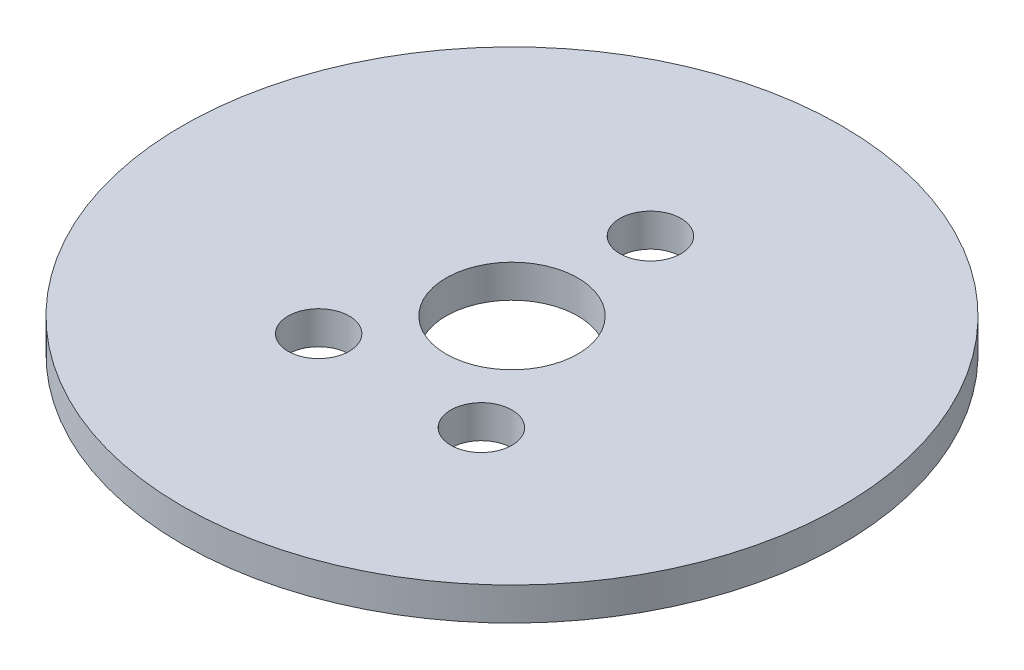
from build123d import *

# Parameters (mm, degrees)
SKETCH1_R           = 15.875
SKETCH1_R_2         = 3.175
SKETCH1_R_3         = 1.4732
BOSS_EXTRUDE1_DEPTH = 1.5875


with BuildPart() as part:
    # Sketch1 → Boss-Extrude1 (new body)
    with BuildSketch(Plane(origin=(0, 0, 0), x_dir=(1, 0, 0), z_dir=(0, 1, 0))):
        with Locations(Location((0.562155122, -11.519594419, 0), (0, 0, 270))):
            Circle(SKETCH1_R)
        with Locations(Location((0.562155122, -11.519594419, 0), (0, 0, 270))):
            Circle(SKETCH1_R_2, mode=Mode.SUBTRACT)
        with Locations(Location((0.562155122, -4.852094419, 0), (0, 0, 270))):
            Circle(SKETCH1_R_3, mode=Mode.SUBTRACT)
        with Locations(Location((4.481213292, -16.913715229, 0), (0, 0, 270))):
            Circle(SKETCH1_R_3, mode=Mode.SUBTRACT)
        with Locations(Location((-3.356903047, -16.913715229, 0), (0, 0, 270))):
            Circle(SKETCH1_R_3, mode=Mode.SUBTRACT)
    extrude(amount=BOSS_EXTRUDE1_DEPTH)


solid = part.part
